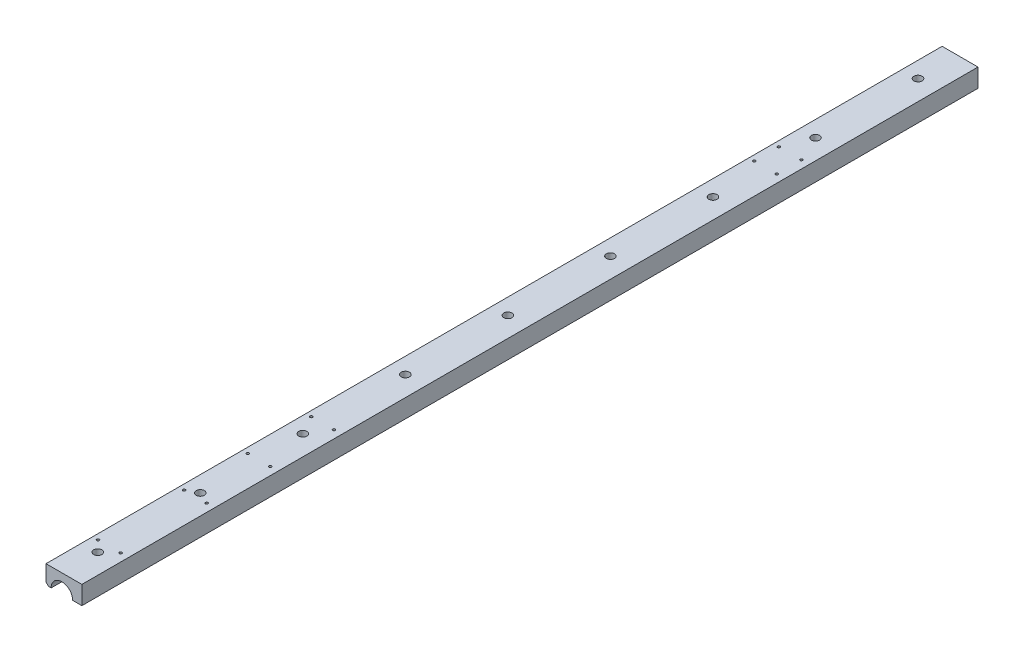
from build123d import *

# Parameters (mm, degrees)
EXTRUSION1_DEPTH           = 1748
TROU_TARAUD_M61_D          = 5
TROU_TARAUD_M61_DEPTH      = 21
TROU_TARAUD_M61_TIP        = 1.502151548
ESQUISSE4_R                = 8
ENL_V_MAT_EXTRU_1_DEPTH    = 1750.771413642
R_P_TITION_LIN_AIRE1_COUNT = 9
R_P_TITION_LIN_AIRE1_PITCH = 200


with BuildPart() as part:
    # Esquisse1 → Extrusion1 (new body)
    with BuildSketch(Plane.XY):
        with BuildLine():
            Line((0, 5), (5, 0))
            Line((5, 0), (10, 0))
            ThreePointArc((10, 0), (31, 21), (52, 0))
            Line((52, 0), (70, 0))
            Line((70, 0), (70, 36))
            Line((70, 36), (0, 36))
            Line((0, 36), (0, 5))
        make_face()
    extrude(amount=EXTRUSION1_DEPTH)

    # Trou taraud_ M61
    with Locations(Plane(origin=(0, 36, 0), x_dir=(-1, 0, 0), z_dir=(0, 1, 0))):
        with Locations((-54.5, 329), (-54.5, 377), (-10.5, 329), (-10.5, 377), (-54.5, 1241), (-10.5, 1241), (-54.5, 1365), (-10.5, 1365), (-54.5, 1489), (-10.5, 1489), (-54.5, 1657), (-10.5, 1657)):
            Hole(TROU_TARAUD_M61_D / 2, depth=TROU_TARAUD_M61_DEPTH)
            with Locations((0, 0, -(TROU_TARAUD_M61_DEPTH + TROU_TARAUD_M61_TIP / 2))):  # 118° drill point
                Cone(0, TROU_TARAUD_M61_D / 2, TROU_TARAUD_M61_TIP, mode=Mode.SUBTRACT)

    # Esquisse4 → Enl_v. mat.-Extru.1 (cut, through all)
    with BuildSketch(Plane(origin=(0, 36, 0), x_dir=(1, 0, 0), z_dir=(0, 1, 0))):
        with Locations(Location((31, -1678, 0), (0, 0, 270))):
            Circle(ESQUISSE4_R)
    enl_v_mat_extru_1 = extrude(amount=-ENL_V_MAT_EXTRU_1_DEPTH, mode=Mode.SUBTRACT)

    # R_p_tition lin_aire1: Enl_v. mat.-Extru.1 ×9
    with Locations(*[(0, 0, -i * R_P_TITION_LIN_AIRE1_PITCH) for i in range(1, R_P_TITION_LIN_AIRE1_COUNT)]):
        add(enl_v_mat_extru_1, mode=Mode.SUBTRACT)


solid = part.part
